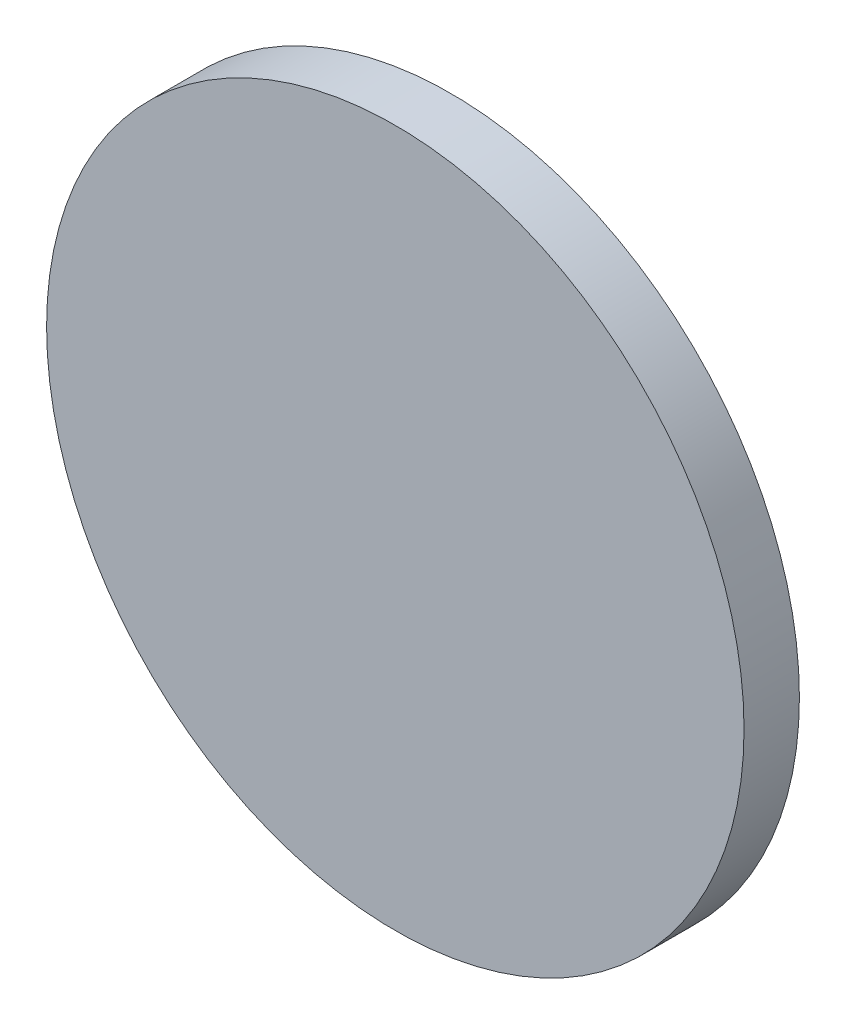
ISO-10303-21;
HEADER;
FILE_DESCRIPTION(('STEP AP214'),'2;1');
FILE_NAME('part.step','',(''),(''),'','','');
FILE_SCHEMA(('AUTOMOTIVE_DESIGN { 1 0 10303 214 1 1 1 1 }'));
ENDSEC;
DATA;
#1=APPLICATION_CONTEXT('core data for automotive mechanical design processes');
#2=APPLICATION_PROTOCOL_DEFINITION('international standard','automotive_design',2000,#1);
#3=PRODUCT_CONTEXT('',#1,'mechanical');
#4=PRODUCT('Part','Part','',(#3));
#5=PRODUCT_RELATED_PRODUCT_CATEGORY('part','',(#4));
#6=PRODUCT_DEFINITION_FORMATION('','',#4);
#7=PRODUCT_DEFINITION_CONTEXT('part definition',#1,'design');
#8=PRODUCT_DEFINITION('design','',#6,#7);
#9=PRODUCT_DEFINITION_SHAPE('','',#8);
#10=(LENGTH_UNIT() NAMED_UNIT(*) SI_UNIT(.MILLI.,.METRE.));
#11=(NAMED_UNIT(*) PLANE_ANGLE_UNIT() SI_UNIT($,.RADIAN.));
#12=(NAMED_UNIT(*) SI_UNIT($,.STERADIAN.) SOLID_ANGLE_UNIT());
#13=UNCERTAINTY_MEASURE_WITH_UNIT(LENGTH_MEASURE(1.E-05),#10,'distance_accuracy_value','');
#14=(GEOMETRIC_REPRESENTATION_CONTEXT(3) GLOBAL_UNCERTAINTY_ASSIGNED_CONTEXT((#13)) GLOBAL_UNIT_ASSIGNED_CONTEXT((#10,
#11,#12)) REPRESENTATION_CONTEXT('',''));
#15=CARTESIAN_POINT('',(0.,0.,0.));
#16=DIRECTION('',(0.,0.,1.));
#17=DIRECTION('',(1.,0.,0.));
#18=AXIS2_PLACEMENT_3D('',#15,#16,#17);
#19=CARTESIAN_POINT('',(0.,0.,2.3333333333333));
#20=DIRECTION('',(0.,0.,-1.));
#21=DIRECTION('',(-1.,0.,0.));
#22=AXIS2_PLACEMENT_3D('',#19,#20,#21);
#23=PLANE('',#22);
#24=CARTESIAN_POINT('',(0.,0.,2.3333333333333));
#25=DIRECTION('',(0.,0.,-1.));
#26=DIRECTION('',(-1.,0.,0.));
#27=AXIS2_PLACEMENT_3D('',#24,#25,#26);
#28=CIRCLE('',#27,20.);
#29=CARTESIAN_POINT('',(-20.,0.,2.3333333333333));
#30=VERTEX_POINT('',#29);
#31=EDGE_CURVE('E8',#30,#30,#28,.T.);
#32=ORIENTED_EDGE('',*,*,#31,.T.);
#33=EDGE_LOOP('',(#32));
#34=FACE_BOUND('',#33,.T.);
#35=ADVANCED_FACE('F12',(#34),#23,.T.);
#36=CARTESIAN_POINT('',(0.,0.,3.3333333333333));
#37=DIRECTION('',(0.,0.,-1.));
#38=DIRECTION('',(-1.,0.,0.));
#39=AXIS2_PLACEMENT_3D('',#36,#37,#38);
#40=CYLINDRICAL_SURFACE('',#39,20.);
#41=CARTESIAN_POINT('',(0.,0.,0.));
#42=DIRECTION('',(0.,0.,-1.));
#43=DIRECTION('',(-1.,0.,0.));
#44=AXIS2_PLACEMENT_3D('',#41,#42,#43);
#45=CIRCLE('',#44,20.);
#46=CARTESIAN_POINT('',(-20.,0.,0.));
#47=VERTEX_POINT('',#46);
#48=EDGE_CURVE('E18',#47,#47,#45,.T.);
#49=ORIENTED_EDGE('',*,*,#48,.T.);
#50=EDGE_LOOP('',(#49));
#51=FACE_BOUND('',#50,.T.);
#52=ORIENTED_EDGE('',*,*,#31,.F.);
#53=EDGE_LOOP('',(#52));
#54=FACE_BOUND('',#53,.T.);
#55=ADVANCED_FACE('F45',(#51,#54),#40,.F.);
#56=CARTESIAN_POINT('',(0.,20.,0.));
#57=DIRECTION('',(0.,0.,-1.));
#58=DIRECTION('',(-1.,0.,0.));
#59=AXIS2_PLACEMENT_3D('',#56,#57,#58);
#60=PLANE('',#59);
#61=CARTESIAN_POINT('',(0.,0.,0.));
#62=DIRECTION('',(0.,0.,-1.));
#63=DIRECTION('',(-1.,0.,0.));
#64=AXIS2_PLACEMENT_3D('',#61,#62,#63);
#65=CIRCLE('',#64,21.);
#66=CARTESIAN_POINT('',(-21.,0.,0.));
#67=VERTEX_POINT('',#66);
#68=EDGE_CURVE('E22',#67,#67,#65,.T.);
#69=ORIENTED_EDGE('',*,*,#68,.T.);
#70=EDGE_LOOP('',(#69));
#71=FACE_BOUND('',#70,.T.);
#72=ORIENTED_EDGE('',*,*,#48,.F.);
#73=EDGE_LOOP('',(#72));
#74=FACE_BOUND('',#73,.T.);
#75=ADVANCED_FACE('F42',(#71,#74),#60,.T.);
#76=CARTESIAN_POINT('',(0.,0.,3.3333333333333));
#77=DIRECTION('',(0.,0.,-1.));
#78=DIRECTION('',(-1.,0.,0.));
#79=AXIS2_PLACEMENT_3D('',#76,#77,#78);
#80=CYLINDRICAL_SURFACE('',#79,21.);
#81=CARTESIAN_POINT('',(0.,0.,3.3333333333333));
#82=DIRECTION('',(0.,0.,-1.));
#83=DIRECTION('',(-1.,0.,0.));
#84=AXIS2_PLACEMENT_3D('',#81,#82,#83);
#85=CIRCLE('',#84,21.);
#86=CARTESIAN_POINT('',(-21.,0.,3.3333333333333));
#87=VERTEX_POINT('',#86);
#88=EDGE_CURVE('E26',#87,#87,#85,.T.);
#89=ORIENTED_EDGE('',*,*,#88,.T.);
#90=EDGE_LOOP('',(#89));
#91=FACE_BOUND('',#90,.T.);
#92=ORIENTED_EDGE('',*,*,#68,.F.);
#93=EDGE_LOOP('',(#92));
#94=FACE_BOUND('',#93,.T.);
#95=ADVANCED_FACE('F32',(#91,#94),#80,.T.);
#96=CARTESIAN_POINT('',(0.,21.,3.3333333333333));
#97=DIRECTION('',(0.,0.,1.));
#98=DIRECTION('',(1.,0.,0.));
#99=AXIS2_PLACEMENT_3D('',#96,#97,#98);
#100=PLANE('',#99);
#101=ORIENTED_EDGE('',*,*,#88,.F.);
#102=EDGE_LOOP('',(#101));
#103=FACE_BOUND('',#102,.T.);
#104=ADVANCED_FACE('F35',(#103),#100,.T.);
#105=CLOSED_SHELL('',(#35,#55,#75,#95,#104));
#106=MANIFOLD_SOLID_BREP('B1',#105);
#107=ADVANCED_BREP_SHAPE_REPRESENTATION('',(#18,#106),#14);
#108=SHAPE_DEFINITION_REPRESENTATION(#9,#107);
ENDSEC;
END-ISO-10303-21;
